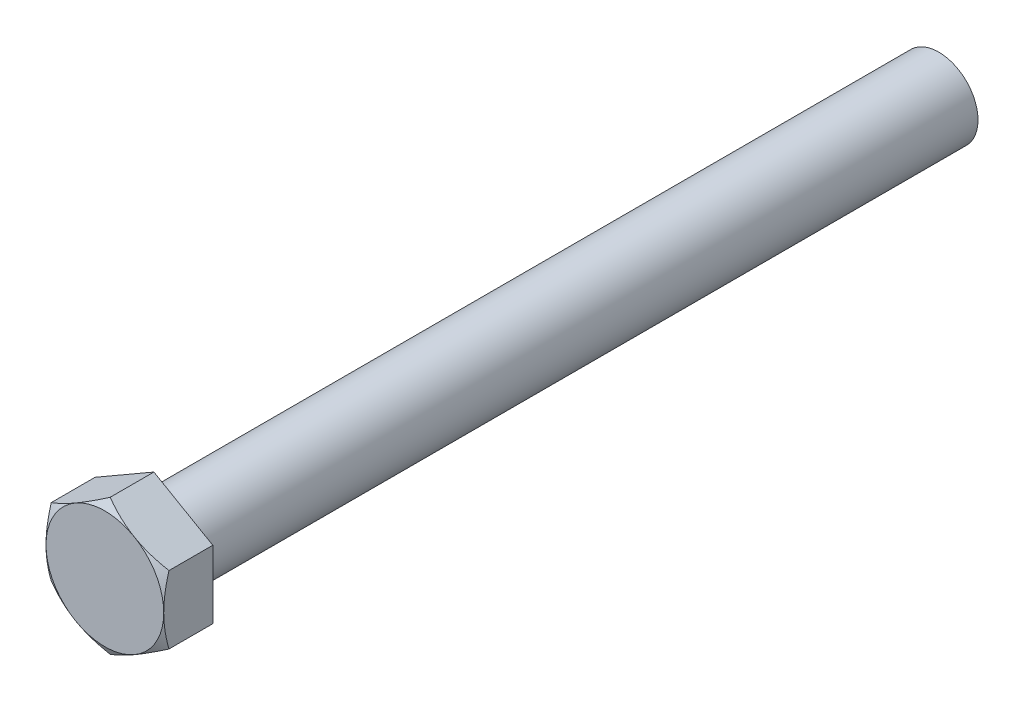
from build123d import *

# Parameters (mm, degrees)
SKETCH1_R           = 12
BOSS_EXTRUDE1_DEPTH = 120
BOSS_EXTRUDE3_DEPTH = 15
SKETCH6_OUTSIDE_W   = 124.814
SKETCH6_OUTSIDE_H   = 130.384
SKETCH6_OUTSIDE_R   = 18
CUT_EXTRUDE1_DEPTH  = 10
CUT_EXTRUDE1_DRAFT  = -60


with BuildPart() as part:
    # Sketch1 → Boss-Extrude1 (new, symmetric)
    with BuildSketch(Plane.XY):
        Circle(SKETCH1_R)
    extrude(amount=BOSS_EXTRUDE1_DEPTH, both=True)

    # Sketch5 → Boss-Extrude3 (add)
    with BuildSketch(Plane.XY.offset(120)):
        Polygon((0, 20.784609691), (-18, 10.392304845), (-18, -10.392304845), (0, -20.784609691), (18, -10.392304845), (18, 10.392304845), align=None)
    extrude(amount=BOSS_EXTRUDE3_DEPTH)


with BuildPart() as cut_extrude1_tool:
    # Sketch6 outside → Cut-Extrude1 (with draft: the straight prism first)
    with BuildSketch(Plane.XY.offset(135)):
        Rectangle(SKETCH6_OUTSIDE_W, SKETCH6_OUTSIDE_H)
        Circle(SKETCH6_OUTSIDE_R, mode=Mode.SUBTRACT)
    extrude(amount=-CUT_EXTRUDE1_DEPTH)
    # Cut-Extrude1: the draft: its side faces are tilted about the plane it starts from
    cut_extrude1_sides = [cut_extrude1_tool.faces().sort_by_distance(p)[0] for p in [
        (0, -65.192, 130),
        (62.407, 0, 130),
        (0, 65.192, 130),
        (-62.407, 0, 130),
        (-18, 0, 130),
    ]]
    draft(cut_extrude1_sides, Plane.XY.offset(135), CUT_EXTRUDE1_DRAFT)


with BuildPart() as part_1:
    add(part.part)

    # Cut-Extrude1: cut by cut_extrude1_tool
    add(cut_extrude1_tool.part, mode=Mode.SUBTRACT)


solid = part_1.part
